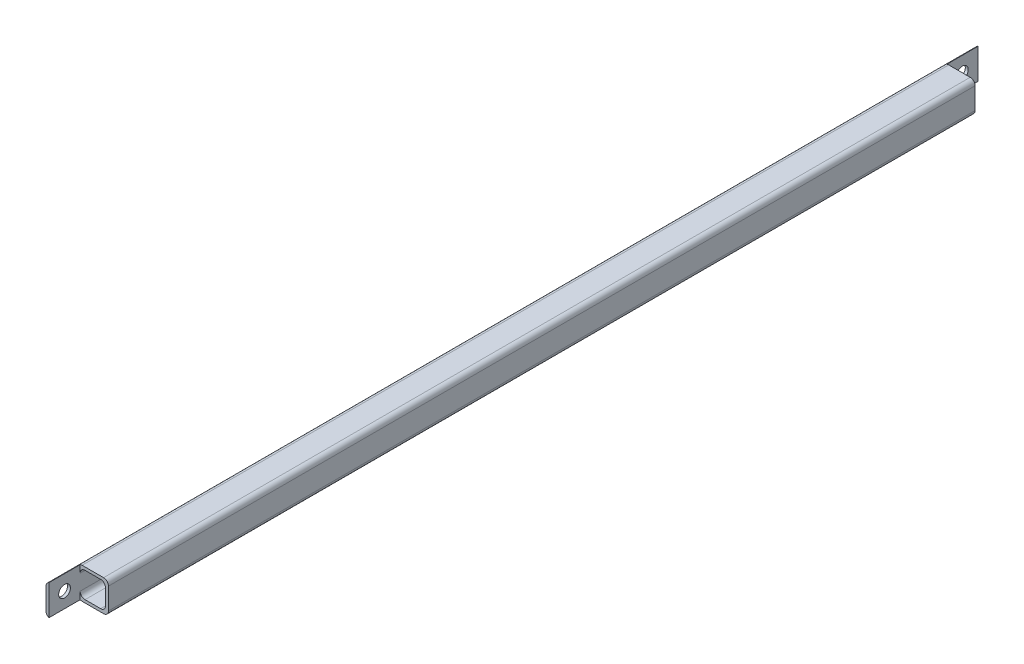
from build123d import *

# Parameters (mm, degrees)
BASE_EXTRUSION_DEPTH         = 238
ENL_V_MAT_EXTRU_1_DEPTH      = 239.26875582
ENL_V_MAT_EXTRU_1_DEPTH_BACK = 239.26875582
ESQUISSE2_W                  = 14.5
ESQUISSE2_H                  = 16
ESQUISSE3_R                  = 3
ENL_V_MAT_EXTRU_2_DEPTH      = 239.26875582


with BuildPart() as part:
    # Esquisse1 → Base-Extrusion (new, symmetric)
    with BuildSketch(Plane.XY):
        with BuildLine():
            Line((-5.5, 8), (5.5, 8))
            ThreePointArc((5.5, 8), (7.267766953, 7.267766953), (8, 5.5))
            Line((8, 5.5), (8, -5.5))
            ThreePointArc((8, -5.5), (7.267766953, -7.267766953), (5.5, -8))
            Line((5.5, -8), (-5.5, -8))
            ThreePointArc((-5.5, -8), (-7.267766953, -7.267766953), (-8, -5.5))
            Line((-8, -5.5), (-8, 5.5))
            ThreePointArc((-8, 5.5), (-7.267766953, 7.267766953), (-5.5, 8))
        make_face()
        with BuildLine():
            Line((-4, 6.5), (4, 6.5))
            ThreePointArc((4, 6.5), (5.767766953, 5.767766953), (6.5, 4))
            Line((6.5, 4), (6.5, -4))
            ThreePointArc((6.5, -4), (5.767766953, -5.767766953), (4, -6.5))
            Line((4, -6.5), (-4, -6.5))
            ThreePointArc((-4, -6.5), (-5.767766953, -5.767766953), (-6.5, -4))
            Line((-6.5, -4), (-6.5, 4))
            ThreePointArc((-6.5, 4), (-5.767766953, 5.767766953), (-4, 6.5))
        make_face(mode=Mode.SUBTRACT)
    extrude(amount=BASE_EXTRUSION_DEPTH, both=True)

    # Esquisse2 → Enl_v. mat.-Extru.1 (cut, two sides: drawn at the far end of the back side and taken through both)
    with BuildSketch(Plane(origin=(0, 0, 0), x_dir=(1, 0, 0), z_dir=(0, 1, 0)).offset(-ENL_V_MAT_EXTRU_1_DEPTH_BACK)):
        with Locations((0.75, 230)):
            Rectangle(ESQUISSE2_W, ESQUISSE2_H)
        with Locations((0.75, -230)):
            Rectangle(ESQUISSE2_W, ESQUISSE2_H)
    extrude(amount=ENL_V_MAT_EXTRU_1_DEPTH + ENL_V_MAT_EXTRU_1_DEPTH_BACK, mode=Mode.SUBTRACT)

    # Esquisse3 → Enl_v. mat.-Extru.2 (cut, through all)
    with BuildSketch(Plane(origin=(0, 0, 0), x_dir=(0, 0, -1), z_dir=(1, 0, 0))):
        with Locations((230, 0)):
            Circle(ESQUISSE3_R)
        with Locations((-230, 0)):
            Circle(ESQUISSE3_R)
    extrude(amount=-ENL_V_MAT_EXTRU_2_DEPTH, mode=Mode.SUBTRACT)


solid = part.part
